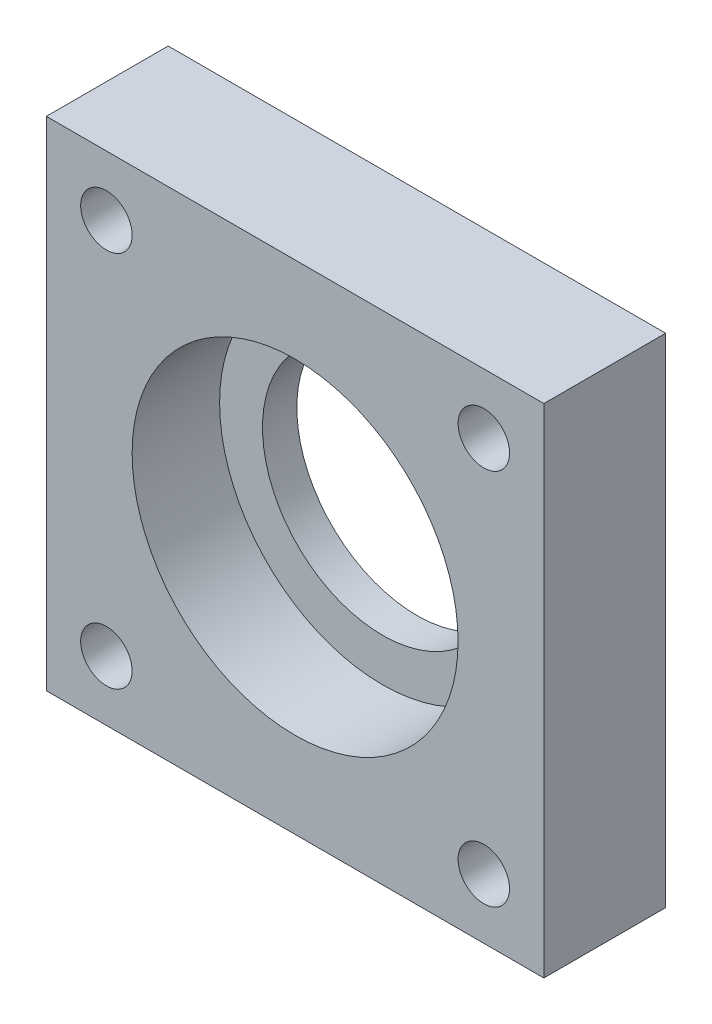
from build123d import *

# Parameters (mm, degrees)
SKETCH_1_W          = 29
SKETCH_1_H          = 29
SKETCH_1_R          = 9.5
EXTRUDE_2_DEPTH     = 5.1
EXTRUDE_START       = -2
SKETCH_1_8_W        = 29
SKETCH_1_8_H        = 29
SKETCH_1_8_R        = 9.5
SKETCH_1_8_R_2      = 7
EXTRUDE_3_DEPTH     = 2
SKETCH_3_R          = 1.5
CUT_EXTRUDE_1_DEPTH = 7.1


with BuildPart() as part:
    # Sketch 1 → Extrude 2 (new body)
    with BuildSketch(Plane.XY):
        with Locations((-7.623161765, -5.224264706)):
            Rectangle(SKETCH_1_W, SKETCH_1_H)
        with Locations((-7.623161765, -5.224264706)):
            Circle(SKETCH_1_R, mode=Mode.SUBTRACT)
    extrude(amount=EXTRUDE_2_DEPTH)

    # Sketch 1_8 → Extrude 3 (add)
    # profile 1 of 2: a face of its own
    with BuildSketch(Plane.XY.offset(EXTRUDE_START)):
        with Locations((-7.623161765, -5.224264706)):
            Rectangle(SKETCH_1_8_W, SKETCH_1_8_H)
        with Locations((-7.623161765, -5.224264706)):
            Circle(SKETCH_1_8_R, mode=Mode.SUBTRACT)
    # profile 2 of 2: a face of its own
    with BuildSketch(Plane.XY.offset(EXTRUDE_START)):
        with Locations((-7.623161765, -5.224264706)):
            Circle(SKETCH_1_8_R)
        with Locations((-7.623161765, -5.224264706)):
            Circle(SKETCH_1_8_R_2, mode=Mode.SUBTRACT)
    extrude(amount=EXTRUDE_3_DEPTH)

    # Sketch 3 → Cut-Extrude 1 (cut)
    with BuildSketch(Plane.XY.offset(5.1)):
        with Locations((-18.623161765, 5.775735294)):
            Circle(SKETCH_3_R)
        with Locations((3.376838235, 5.775735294)):
            Circle(SKETCH_3_R)
        with Locations((3.376838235, -16.224264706)):
            Circle(SKETCH_3_R)
        with Locations((-18.623161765, -16.224264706)):
            Circle(SKETCH_3_R)
    extrude(amount=-CUT_EXTRUDE_1_DEPTH, mode=Mode.SUBTRACT)


solid = part.part
